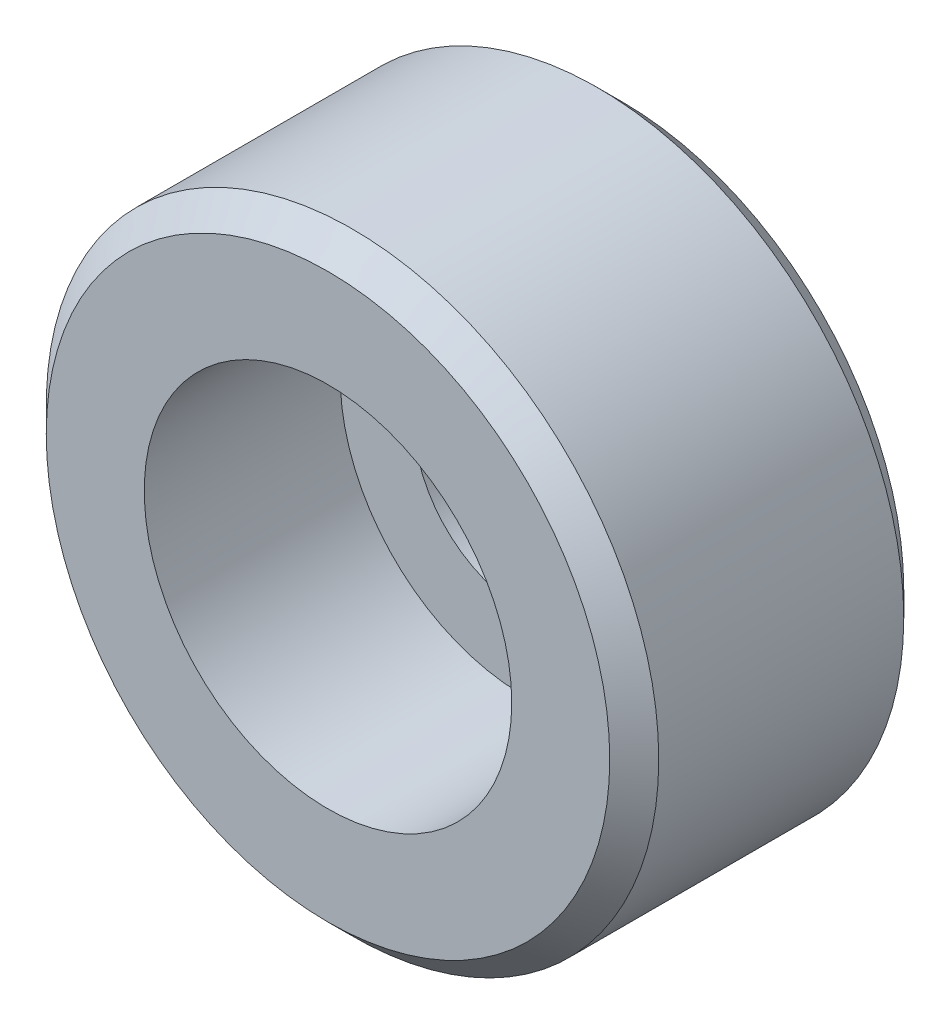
ISO-10303-21;
HEADER;
FILE_DESCRIPTION(('STEP AP214'),'2;1');
FILE_NAME('part.step','',(''),(''),'','','');
FILE_SCHEMA(('AUTOMOTIVE_DESIGN { 1 0 10303 214 1 1 1 1 }'));
ENDSEC;
DATA;
#1=APPLICATION_CONTEXT('core data for automotive mechanical design processes');
#2=APPLICATION_PROTOCOL_DEFINITION('international standard','automotive_design',2000,#1);
#3=PRODUCT_CONTEXT('',#1,'mechanical');
#4=PRODUCT('Part','Part','',(#3));
#5=PRODUCT_RELATED_PRODUCT_CATEGORY('part','',(#4));
#6=PRODUCT_DEFINITION_FORMATION('','',#4);
#7=PRODUCT_DEFINITION_CONTEXT('part definition',#1,'design');
#8=PRODUCT_DEFINITION('design','',#6,#7);
#9=PRODUCT_DEFINITION_SHAPE('','',#8);
#10=(LENGTH_UNIT() NAMED_UNIT(*) SI_UNIT(.MILLI.,.METRE.));
#11=(NAMED_UNIT(*) PLANE_ANGLE_UNIT() SI_UNIT($,.RADIAN.));
#12=(NAMED_UNIT(*) SI_UNIT($,.STERADIAN.) SOLID_ANGLE_UNIT());
#13=UNCERTAINTY_MEASURE_WITH_UNIT(LENGTH_MEASURE(1.E-05),#10,'distance_accuracy_value','');
#14=(GEOMETRIC_REPRESENTATION_CONTEXT(3) GLOBAL_UNCERTAINTY_ASSIGNED_CONTEXT((#13)) GLOBAL_UNIT_ASSIGNED_CONTEXT((#10,
#11,#12)) REPRESENTATION_CONTEXT('',''));
#15=CARTESIAN_POINT('',(0.,0.,0.));
#16=DIRECTION('',(0.,0.,1.));
#17=DIRECTION('',(1.,0.,0.));
#18=AXIS2_PLACEMENT_3D('',#15,#16,#17);
#19=CARTESIAN_POINT('',(0.,0.,12.));
#20=DIRECTION('',(0.,0.,-1.));
#21=DIRECTION('',(-1.,0.,0.));
#22=AXIS2_PLACEMENT_3D('',#19,#20,#21);
#23=CYLINDRICAL_SURFACE('',#22,12.5);
#24=CARTESIAN_POINT('',(0.,0.,11.));
#25=DIRECTION('',(0.,0.,1.));
#26=DIRECTION('',(1.,0.,0.));
#27=AXIS2_PLACEMENT_3D('',#24,#25,#26);
#28=CIRCLE('',#27,12.5);
#29=CARTESIAN_POINT('',(12.5,0.,11.));
#30=VERTEX_POINT('',#29);
#31=EDGE_CURVE('E36',#30,#30,#28,.F.);
#32=ORIENTED_EDGE('',*,*,#31,.T.);
#33=EDGE_LOOP('',(#32));
#34=FACE_BOUND('',#33,.T.);
#35=CARTESIAN_POINT('',(0.,0.,0.999999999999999));
#36=DIRECTION('',(0.,0.,1.));
#37=DIRECTION('',(1.,0.,0.));
#38=AXIS2_PLACEMENT_3D('',#35,#36,#37);
#39=CIRCLE('',#38,12.5);
#40=CARTESIAN_POINT('',(12.5,0.,0.999999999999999));
#41=VERTEX_POINT('',#40);
#42=EDGE_CURVE('E40',#41,#41,#39,.T.);
#43=ORIENTED_EDGE('',*,*,#42,.T.);
#44=EDGE_LOOP('',(#43));
#45=FACE_BOUND('',#44,.T.);
#46=ADVANCED_FACE('F29',(#34,#45),#23,.T.);
#47=CARTESIAN_POINT('',(0.,0.,12.));
#48=DIRECTION('',(0.,0.,1.));
#49=DIRECTION('',(1.,0.,0.));
#50=AXIS2_PLACEMENT_3D('',#47,#48,#49);
#51=PLANE('',#50);
#52=CARTESIAN_POINT('',(0.,0.,12.));
#53=DIRECTION('',(0.,0.,1.));
#54=DIRECTION('',(1.,0.,0.));
#55=AXIS2_PLACEMENT_3D('',#52,#53,#54);
#56=CIRCLE('',#55,11.5);
#57=CARTESIAN_POINT('',(11.5,0.,12.));
#58=VERTEX_POINT('',#57);
#59=EDGE_CURVE('E44',#58,#58,#56,.T.);
#60=ORIENTED_EDGE('',*,*,#59,.T.);
#61=EDGE_LOOP('',(#60));
#62=FACE_BOUND('',#61,.T.);
#63=CARTESIAN_POINT('',(0.,0.,12.));
#64=DIRECTION('',(0.,0.,1.));
#65=DIRECTION('',(1.,0.,0.));
#66=AXIS2_PLACEMENT_3D('',#63,#64,#65);
#67=CIRCLE('',#66,7.5);
#68=CARTESIAN_POINT('',(7.5,0.,12.));
#69=VERTEX_POINT('',#68);
#70=EDGE_CURVE('E58',#69,#69,#67,.T.);
#71=ORIENTED_EDGE('',*,*,#70,.F.);
#72=EDGE_LOOP('',(#71));
#73=FACE_BOUND('',#72,.T.);
#74=ADVANCED_FACE('F64',(#62,#73),#51,.T.);
#75=CARTESIAN_POINT('',(0.,0.,0.));
#76=DIRECTION('',(0.,0.,1.));
#77=DIRECTION('',(1.,0.,0.));
#78=AXIS2_PLACEMENT_3D('',#75,#76,#77);
#79=PLANE('',#78);
#80=CARTESIAN_POINT('',(0.,0.,0.));
#81=DIRECTION('',(0.,0.,1.));
#82=DIRECTION('',(1.,0.,0.));
#83=AXIS2_PLACEMENT_3D('',#80,#81,#82);
#84=CIRCLE('',#83,11.5);
#85=CARTESIAN_POINT('',(11.5,0.,0.));
#86=VERTEX_POINT('',#85);
#87=EDGE_CURVE('E10',#86,#86,#84,.F.);
#88=ORIENTED_EDGE('',*,*,#87,.T.);
#89=EDGE_LOOP('',(#88));
#90=FACE_BOUND('',#89,.T.);
#91=CARTESIAN_POINT('',(0.,0.,0.));
#92=DIRECTION('',(0.,0.,1.));
#93=DIRECTION('',(1.,0.,0.));
#94=AXIS2_PLACEMENT_3D('',#91,#92,#93);
#95=CIRCLE('',#94,4.5);
#96=CARTESIAN_POINT('',(4.5,0.,0.));
#97=VERTEX_POINT('',#96);
#98=EDGE_CURVE('E49',#97,#97,#95,.T.);
#99=ORIENTED_EDGE('',*,*,#98,.T.);
#100=EDGE_LOOP('',(#99));
#101=FACE_BOUND('',#100,.T.);
#102=ADVANCED_FACE('F66',(#90,#101),#79,.F.);
#103=CARTESIAN_POINT('',(0.,0.,12.));
#104=DIRECTION('',(0.,0.,1.));
#105=DIRECTION('',(1.,0.,0.));
#106=AXIS2_PLACEMENT_3D('',#103,#104,#105);
#107=CYLINDRICAL_SURFACE('',#106,4.5);
#108=ORIENTED_EDGE('',*,*,#98,.F.);
#109=EDGE_LOOP('',(#108));
#110=FACE_BOUND('',#109,.T.);
#111=CARTESIAN_POINT('',(0.,0.,4.));
#112=DIRECTION('',(0.,0.,1.));
#113=DIRECTION('',(1.,0.,0.));
#114=AXIS2_PLACEMENT_3D('',#111,#112,#113);
#115=CIRCLE('',#114,4.5);
#116=CARTESIAN_POINT('',(4.5,0.,4.));
#117=VERTEX_POINT('',#116);
#118=EDGE_CURVE('E52',#117,#117,#115,.T.);
#119=ORIENTED_EDGE('',*,*,#118,.T.);
#120=EDGE_LOOP('',(#119));
#121=FACE_BOUND('',#120,.T.);
#122=ADVANCED_FACE('F73',(#110,#121),#107,.F.);
#123=CARTESIAN_POINT('',(4.5,0.,4.));
#124=DIRECTION('',(0.,0.,-1.));
#125=DIRECTION('',(-1.,0.,0.));
#126=AXIS2_PLACEMENT_3D('',#123,#124,#125);
#127=PLANE('',#126);
#128=ORIENTED_EDGE('',*,*,#118,.F.);
#129=EDGE_LOOP('',(#128));
#130=FACE_BOUND('',#129,.T.);
#131=CARTESIAN_POINT('',(0.,0.,4.));
#132=DIRECTION('',(0.,0.,1.));
#133=DIRECTION('',(1.,0.,0.));
#134=AXIS2_PLACEMENT_3D('',#131,#132,#133);
#135=CIRCLE('',#134,7.5);
#136=CARTESIAN_POINT('',(7.5,0.,4.));
#137=VERTEX_POINT('',#136);
#138=EDGE_CURVE('E55',#137,#137,#135,.T.);
#139=ORIENTED_EDGE('',*,*,#138,.T.);
#140=EDGE_LOOP('',(#139));
#141=FACE_BOUND('',#140,.T.);
#142=ADVANCED_FACE('F86',(#130,#141),#127,.F.);
#143=CARTESIAN_POINT('',(0.,0.,12.));
#144=DIRECTION('',(0.,0.,1.));
#145=DIRECTION('',(1.,0.,0.));
#146=AXIS2_PLACEMENT_3D('',#143,#144,#145);
#147=CYLINDRICAL_SURFACE('',#146,7.5);
#148=ORIENTED_EDGE('',*,*,#138,.F.);
#149=EDGE_LOOP('',(#148));
#150=FACE_BOUND('',#149,.T.);
#151=ORIENTED_EDGE('',*,*,#70,.T.);
#152=EDGE_LOOP('',(#151));
#153=FACE_BOUND('',#152,.T.);
#154=ADVANCED_FACE('F62',(#150,#153),#147,.F.);
#155=CARTESIAN_POINT('',(0.,0.,12.));
#156=DIRECTION('',(0.,0.,-1.));
#157=DIRECTION('',(-1.,0.,0.));
#158=AXIS2_PLACEMENT_3D('',#155,#156,#157);
#159=CONICAL_SURFACE('',#158,11.5,0.785398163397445);
#160=ORIENTED_EDGE('',*,*,#31,.F.);
#161=EDGE_LOOP('',(#160));
#162=FACE_BOUND('',#161,.T.);
#163=ORIENTED_EDGE('',*,*,#59,.F.);
#164=EDGE_LOOP('',(#163));
#165=FACE_BOUND('',#164,.T.);
#166=ADVANCED_FACE('F78',(#162,#165),#159,.T.);
#167=CARTESIAN_POINT('',(0.,0.,0.999999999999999));
#168=DIRECTION('',(0.,0.,1.));
#169=DIRECTION('',(1.,0.,0.));
#170=AXIS2_PLACEMENT_3D('',#167,#168,#169);
#171=CONICAL_SURFACE('',#170,12.5,0.78539816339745);
#172=ORIENTED_EDGE('',*,*,#87,.F.);
#173=EDGE_LOOP('',(#172));
#174=FACE_BOUND('',#173,.T.);
#175=ORIENTED_EDGE('',*,*,#42,.F.);
#176=EDGE_LOOP('',(#175));
#177=FACE_BOUND('',#176,.T.);
#178=ADVANCED_FACE('F31',(#174,#177),#171,.T.);
#179=CLOSED_SHELL('',(#46,#74,#102,#122,#142,#154,#166,#178));
#180=MANIFOLD_SOLID_BREP('B2',#179);
#181=ADVANCED_BREP_SHAPE_REPRESENTATION('',(#18,#180),#14);
#182=SHAPE_DEFINITION_REPRESENTATION(#9,#181);
ENDSEC;
END-ISO-10303-21;
